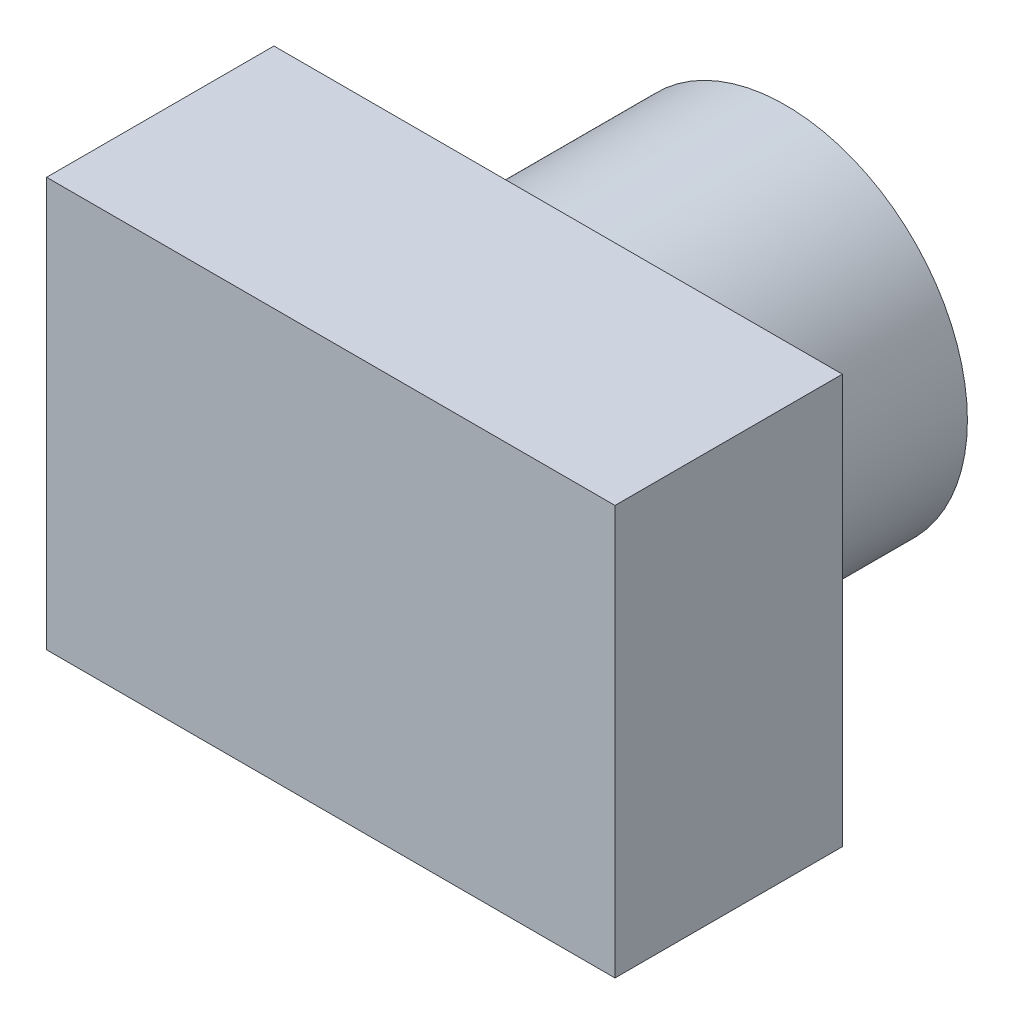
ISO-10303-21;
HEADER;
FILE_DESCRIPTION(('STEP AP214'),'2;1');
FILE_NAME('part.step','',(''),(''),'','','');
FILE_SCHEMA(('AUTOMOTIVE_DESIGN { 1 0 10303 214 1 1 1 1 }'));
ENDSEC;
DATA;
#1=APPLICATION_CONTEXT('core data for automotive mechanical design processes');
#2=APPLICATION_PROTOCOL_DEFINITION('international standard','automotive_design',2000,#1);
#3=PRODUCT_CONTEXT('',#1,'mechanical');
#4=PRODUCT('Part','Part','',(#3));
#5=PRODUCT_RELATED_PRODUCT_CATEGORY('part','',(#4));
#6=PRODUCT_DEFINITION_FORMATION('','',#4);
#7=PRODUCT_DEFINITION_CONTEXT('part definition',#1,'design');
#8=PRODUCT_DEFINITION('design','',#6,#7);
#9=PRODUCT_DEFINITION_SHAPE('','',#8);
#10=(LENGTH_UNIT() NAMED_UNIT(*) SI_UNIT(.MILLI.,.METRE.));
#11=(NAMED_UNIT(*) PLANE_ANGLE_UNIT() SI_UNIT($,.RADIAN.));
#12=(NAMED_UNIT(*) SI_UNIT($,.STERADIAN.) SOLID_ANGLE_UNIT());
#13=UNCERTAINTY_MEASURE_WITH_UNIT(LENGTH_MEASURE(1.E-05),#10,'distance_accuracy_value','');
#14=(GEOMETRIC_REPRESENTATION_CONTEXT(3) GLOBAL_UNCERTAINTY_ASSIGNED_CONTEXT((#13)) GLOBAL_UNIT_ASSIGNED_CONTEXT((#10,
#11,#12)) REPRESENTATION_CONTEXT('',''));
#15=CARTESIAN_POINT('',(0.,0.,0.));
#16=DIRECTION('',(0.,0.,1.));
#17=DIRECTION('',(1.,0.,0.));
#18=AXIS2_PLACEMENT_3D('',#15,#16,#17);
#19=CARTESIAN_POINT('',(0.,-18.,0.));
#20=DIRECTION('',(0.,0.,1.));
#21=DIRECTION('',(1.,0.,0.));
#22=AXIS2_PLACEMENT_3D('',#19,#20,#21);
#23=PLANE('',#22);
#24=DIRECTION('',(0.,-1.,0.));
#25=VECTOR('',#24,1.);
#26=CARTESIAN_POINT('',(0.,0.,0.));
#27=LINE('',#26,#25);
#28=CARTESIAN_POINT('',(0.,0.,0.));
#29=VERTEX_POINT('',#28);
#30=CARTESIAN_POINT('',(0.,-18.,0.));
#31=VERTEX_POINT('',#30);
#32=EDGE_CURVE('E101',#29,#31,#27,.T.);
#33=ORIENTED_EDGE('',*,*,#32,.F.);
#34=DIRECTION('',(-1.,0.,0.));
#35=VECTOR('',#34,1.);
#36=CARTESIAN_POINT('',(0.,0.,0.));
#37=LINE('',#36,#35);
#38=CARTESIAN_POINT('',(25.,0.,0.));
#39=VERTEX_POINT('',#38);
#40=EDGE_CURVE('E74',#39,#29,#37,.T.);
#41=ORIENTED_EDGE('',*,*,#40,.F.);
#42=DIRECTION('',(0.,1.,0.));
#43=VECTOR('',#42,1.);
#44=CARTESIAN_POINT('',(25.,0.,0.));
#45=LINE('',#44,#43);
#46=CARTESIAN_POINT('',(25.,-18.,0.));
#47=VERTEX_POINT('',#46);
#48=EDGE_CURVE('E68',#47,#39,#45,.T.);
#49=ORIENTED_EDGE('',*,*,#48,.F.);
#50=DIRECTION('',(1.,0.,0.));
#51=VECTOR('',#50,1.);
#52=CARTESIAN_POINT('',(0.,-18.,0.));
#53=LINE('',#52,#51);
#54=EDGE_CURVE('E92',#31,#47,#53,.T.);
#55=ORIENTED_EDGE('',*,*,#54,.F.);
#56=EDGE_LOOP('',(#33,#41,#49,#55));
#57=FACE_BOUND('',#56,.T.);
#58=CARTESIAN_POINT('',(12.5,-9.,0.));
#59=DIRECTION('',(0.,0.,1.));
#60=DIRECTION('',(1.,0.,0.));
#61=AXIS2_PLACEMENT_3D('',#58,#59,#60);
#62=CIRCLE('',#61,8.);
#63=CARTESIAN_POINT('',(20.5,-9.,0.));
#64=VERTEX_POINT('',#63);
#65=EDGE_CURVE('E11',#64,#64,#62,.F.);
#66=ORIENTED_EDGE('',*,*,#65,.F.);
#67=EDGE_LOOP('',(#66));
#68=FACE_BOUND('',#67,.T.);
#69=ADVANCED_FACE('F34',(#57,#68),#23,.F.);
#70=CARTESIAN_POINT('',(0.,0.,10.));
#71=DIRECTION('',(1.,0.,0.));
#72=DIRECTION('',(0.,1.,0.));
#73=AXIS2_PLACEMENT_3D('',#70,#71,#72);
#74=PLANE('',#73);
#75=ORIENTED_EDGE('',*,*,#32,.T.);
#76=DIRECTION('',(0.,0.,-1.));
#77=VECTOR('',#76,1.);
#78=CARTESIAN_POINT('',(0.,-18.,10.));
#79=LINE('',#78,#77);
#80=CARTESIAN_POINT('',(0.,-18.,10.));
#81=VERTEX_POINT('',#80);
#82=EDGE_CURVE('E43',#81,#31,#79,.T.);
#83=ORIENTED_EDGE('',*,*,#82,.F.);
#84=DIRECTION('',(0.,-1.,0.));
#85=VECTOR('',#84,1.);
#86=CARTESIAN_POINT('',(0.,0.,10.));
#87=LINE('',#86,#85);
#88=CARTESIAN_POINT('',(0.,0.,10.));
#89=VERTEX_POINT('',#88);
#90=EDGE_CURVE('E87',#89,#81,#87,.T.);
#91=ORIENTED_EDGE('',*,*,#90,.F.);
#92=DIRECTION('',(0.,0.,-1.));
#93=VECTOR('',#92,1.);
#94=CARTESIAN_POINT('',(0.,0.,10.));
#95=LINE('',#94,#93);
#96=EDGE_CURVE('E97',#89,#29,#95,.T.);
#97=ORIENTED_EDGE('',*,*,#96,.T.);
#98=EDGE_LOOP('',(#75,#83,#91,#97));
#99=FACE_BOUND('',#98,.T.);
#100=ADVANCED_FACE('F36',(#99),#74,.F.);
#101=CARTESIAN_POINT('',(0.,-18.,10.));
#102=DIRECTION('',(0.,1.,0.));
#103=DIRECTION('',(0.,0.,1.));
#104=AXIS2_PLACEMENT_3D('',#101,#102,#103);
#105=PLANE('',#104);
#106=ORIENTED_EDGE('',*,*,#54,.T.);
#107=DIRECTION('',(0.,0.,-1.));
#108=VECTOR('',#107,1.);
#109=CARTESIAN_POINT('',(25.,-18.,10.));
#110=LINE('',#109,#108);
#111=CARTESIAN_POINT('',(25.,-18.,10.));
#112=VERTEX_POINT('',#111);
#113=EDGE_CURVE('E90',#112,#47,#110,.T.);
#114=ORIENTED_EDGE('',*,*,#113,.F.);
#115=DIRECTION('',(1.,0.,0.));
#116=VECTOR('',#115,1.);
#117=CARTESIAN_POINT('',(0.,-18.,10.));
#118=LINE('',#117,#116);
#119=EDGE_CURVE('E82',#81,#112,#118,.T.);
#120=ORIENTED_EDGE('',*,*,#119,.F.);
#121=ORIENTED_EDGE('',*,*,#82,.T.);
#122=EDGE_LOOP('',(#106,#114,#120,#121));
#123=FACE_BOUND('',#122,.T.);
#124=ADVANCED_FACE('F91',(#123),#105,.F.);
#125=CARTESIAN_POINT('',(25.,0.,10.));
#126=DIRECTION('',(-1.,0.,0.));
#127=DIRECTION('',(0.,-1.,0.));
#128=AXIS2_PLACEMENT_3D('',#125,#126,#127);
#129=PLANE('',#128);
#130=ORIENTED_EDGE('',*,*,#48,.T.);
#131=DIRECTION('',(0.,0.,-1.));
#132=VECTOR('',#131,1.);
#133=CARTESIAN_POINT('',(25.,0.,10.));
#134=LINE('',#133,#132);
#135=CARTESIAN_POINT('',(25.,0.,10.));
#136=VERTEX_POINT('',#135);
#137=EDGE_CURVE('E93',#136,#39,#134,.T.);
#138=ORIENTED_EDGE('',*,*,#137,.F.);
#139=DIRECTION('',(0.,1.,0.));
#140=VECTOR('',#139,1.);
#141=CARTESIAN_POINT('',(25.,0.,10.));
#142=LINE('',#141,#140);
#143=EDGE_CURVE('E85',#112,#136,#142,.T.);
#144=ORIENTED_EDGE('',*,*,#143,.F.);
#145=ORIENTED_EDGE('',*,*,#113,.T.);
#146=EDGE_LOOP('',(#130,#138,#144,#145));
#147=FACE_BOUND('',#146,.T.);
#148=ADVANCED_FACE('F95',(#147),#129,.F.);
#149=CARTESIAN_POINT('',(0.,0.,10.));
#150=DIRECTION('',(0.,-1.,0.));
#151=DIRECTION('',(0.,0.,-1.));
#152=AXIS2_PLACEMENT_3D('',#149,#150,#151);
#153=PLANE('',#152);
#154=ORIENTED_EDGE('',*,*,#40,.T.);
#155=ORIENTED_EDGE('',*,*,#96,.F.);
#156=DIRECTION('',(-1.,0.,0.));
#157=VECTOR('',#156,1.);
#158=CARTESIAN_POINT('',(0.,0.,10.));
#159=LINE('',#158,#157);
#160=EDGE_CURVE('E51',#136,#89,#159,.T.);
#161=ORIENTED_EDGE('',*,*,#160,.F.);
#162=ORIENTED_EDGE('',*,*,#137,.T.);
#163=EDGE_LOOP('',(#154,#155,#161,#162));
#164=FACE_BOUND('',#163,.T.);
#165=ADVANCED_FACE('F128',(#164),#153,.F.);
#166=CARTESIAN_POINT('',(0.,-18.,10.));
#167=DIRECTION('',(0.,0.,1.));
#168=DIRECTION('',(1.,0.,0.));
#169=AXIS2_PLACEMENT_3D('',#166,#167,#168);
#170=PLANE('',#169);
#171=ORIENTED_EDGE('',*,*,#90,.T.);
#172=ORIENTED_EDGE('',*,*,#119,.T.);
#173=ORIENTED_EDGE('',*,*,#143,.T.);
#174=ORIENTED_EDGE('',*,*,#160,.T.);
#175=EDGE_LOOP('',(#171,#172,#173,#174));
#176=FACE_BOUND('',#175,.T.);
#177=ADVANCED_FACE('F83',(#176),#170,.T.);
#178=CARTESIAN_POINT('',(12.5,-9.,-10.));
#179=DIRECTION('',(0.,0.,1.));
#180=DIRECTION('',(1.,0.,0.));
#181=AXIS2_PLACEMENT_3D('',#178,#179,#180);
#182=CYLINDRICAL_SURFACE('',#181,8.);
#183=CARTESIAN_POINT('',(12.5,-9.,-10.));
#184=DIRECTION('',(0.,0.,-1.));
#185=DIRECTION('',(-1.,0.,0.));
#186=AXIS2_PLACEMENT_3D('',#183,#184,#185);
#187=CIRCLE('',#186,8.);
#188=CARTESIAN_POINT('',(4.5,-9.,-10.));
#189=VERTEX_POINT('',#188);
#190=EDGE_CURVE('E104',#189,#189,#187,.T.);
#191=ORIENTED_EDGE('',*,*,#190,.F.);
#192=EDGE_LOOP('',(#191));
#193=FACE_BOUND('',#192,.T.);
#194=ORIENTED_EDGE('',*,*,#65,.T.);
#195=EDGE_LOOP('',(#194));
#196=FACE_BOUND('',#195,.T.);
#197=ADVANCED_FACE('F117',(#193,#196),#182,.T.);
#198=CARTESIAN_POINT('',(12.5,-9.,-10.));
#199=DIRECTION('',(0.,0.,-1.));
#200=DIRECTION('',(-1.,0.,0.));
#201=AXIS2_PLACEMENT_3D('',#198,#199,#200);
#202=PLANE('',#201);
#203=ORIENTED_EDGE('',*,*,#190,.T.);
#204=EDGE_LOOP('',(#203));
#205=FACE_BOUND('',#204,.T.);
#206=ADVANCED_FACE('F119',(#205),#202,.T.);
#207=CLOSED_SHELL('',(#69,#100,#124,#148,#165,#177,#197,#206));
#208=MANIFOLD_SOLID_BREP('B2',#207);
#209=ADVANCED_BREP_SHAPE_REPRESENTATION('',(#18,#208),#14);
#210=SHAPE_DEFINITION_REPRESENTATION(#9,#209);
ENDSEC;
END-ISO-10303-21;
